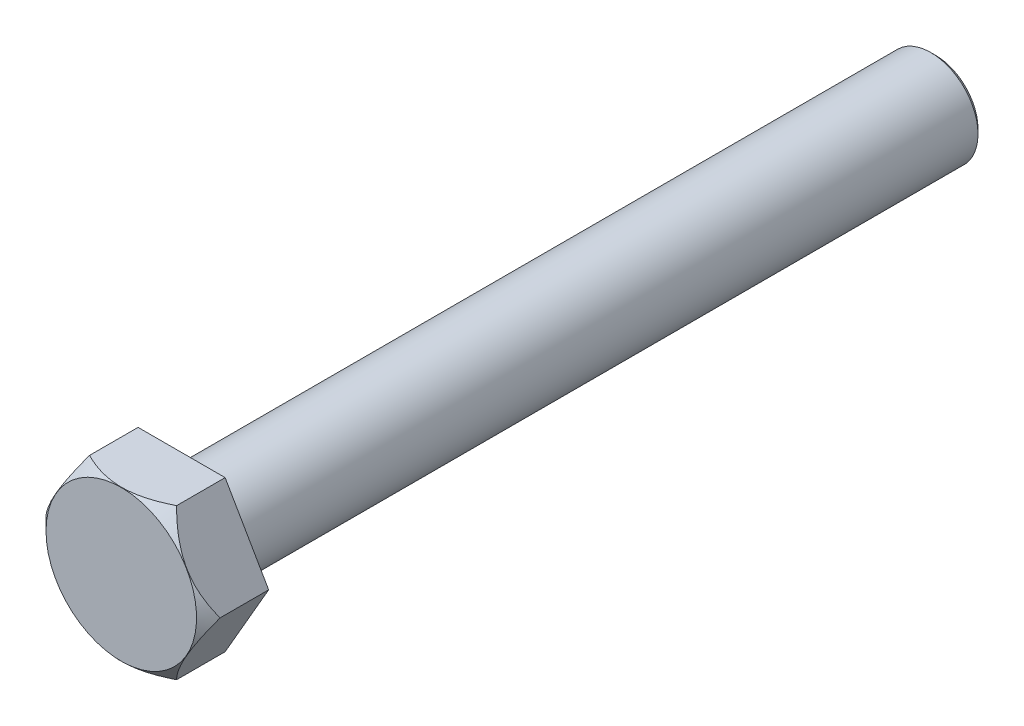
ISO-10303-21;
HEADER;
FILE_DESCRIPTION(('STEP AP214'),'2;1');
FILE_NAME('part.step','',(''),(''),'','','');
FILE_SCHEMA(('AUTOMOTIVE_DESIGN { 1 0 10303 214 1 1 1 1 }'));
ENDSEC;
DATA;
#1=APPLICATION_CONTEXT('core data for automotive mechanical design processes');
#2=APPLICATION_PROTOCOL_DEFINITION('international standard','automotive_design',2000,#1);
#3=PRODUCT_CONTEXT('',#1,'mechanical');
#4=PRODUCT('Part','Part','',(#3));
#5=PRODUCT_RELATED_PRODUCT_CATEGORY('part','',(#4));
#6=PRODUCT_DEFINITION_FORMATION('','',#4);
#7=PRODUCT_DEFINITION_CONTEXT('part definition',#1,'design');
#8=PRODUCT_DEFINITION('design','',#6,#7);
#9=PRODUCT_DEFINITION_SHAPE('','',#8);
#10=(LENGTH_UNIT() NAMED_UNIT(*) SI_UNIT(.MILLI.,.METRE.));
#11=(NAMED_UNIT(*) PLANE_ANGLE_UNIT() SI_UNIT($,.RADIAN.));
#12=(NAMED_UNIT(*) SI_UNIT($,.STERADIAN.) SOLID_ANGLE_UNIT());
#13=UNCERTAINTY_MEASURE_WITH_UNIT(LENGTH_MEASURE(1.E-05),#10,'distance_accuracy_value','');
#14=(GEOMETRIC_REPRESENTATION_CONTEXT(3) GLOBAL_UNCERTAINTY_ASSIGNED_CONTEXT((#13)) GLOBAL_UNIT_ASSIGNED_CONTEXT((#10,
#11,#12)) REPRESENTATION_CONTEXT('',''));
#15=CARTESIAN_POINT('',(0.,0.,0.));
#16=DIRECTION('',(0.,0.,1.));
#17=DIRECTION('',(1.,0.,0.));
#18=AXIS2_PLACEMENT_3D('',#15,#16,#17);
#19=CARTESIAN_POINT('',(0.,-5.,0.));
#20=DIRECTION('',(0.,0.,1.));
#21=DIRECTION('',(1.,0.,0.));
#22=AXIS2_PLACEMENT_3D('',#19,#20,#21);
#23=PLANE('',#22);
#24=CARTESIAN_POINT('',(0.,0.,0.));
#25=DIRECTION('',(0.,0.,1.));
#26=DIRECTION('',(1.,0.,0.));
#27=AXIS2_PLACEMENT_3D('',#24,#25,#26);
#28=CIRCLE('',#27,5.);
#29=CARTESIAN_POINT('',(5.,0.,0.));
#30=VERTEX_POINT('',#29);
#31=EDGE_CURVE('E11',#30,#30,#28,.T.);
#32=ORIENTED_EDGE('',*,*,#31,.T.);
#33=EDGE_LOOP('',(#32));
#34=FACE_BOUND('',#33,.T.);
#35=ADVANCED_FACE('F38',(#34),#23,.T.);
#36=CARTESIAN_POINT('',(0.,0.,0.));
#37=DIRECTION('',(0.,0.,1.));
#38=DIRECTION('',(1.,0.,0.));
#39=AXIS2_PLACEMENT_3D('',#36,#37,#38);
#40=CYLINDRICAL_SURFACE('',#39,5.);
#41=CARTESIAN_POINT('',(0.,0.,-79.5));
#42=DIRECTION('',(0.,0.,1.));
#43=DIRECTION('',(1.,0.,0.));
#44=AXIS2_PLACEMENT_3D('',#41,#42,#43);
#45=CIRCLE('',#44,5.);
#46=CARTESIAN_POINT('',(5.,0.,-79.5));
#47=VERTEX_POINT('',#46);
#48=EDGE_CURVE('E44',#47,#47,#45,.T.);
#49=ORIENTED_EDGE('',*,*,#48,.T.);
#50=EDGE_LOOP('',(#49));
#51=FACE_BOUND('',#50,.T.);
#52=ORIENTED_EDGE('',*,*,#31,.F.);
#53=EDGE_LOOP('',(#52));
#54=FACE_BOUND('',#53,.T.);
#55=ADVANCED_FACE('F64',(#51,#54),#40,.T.);
#56=CARTESIAN_POINT('',(0.,0.,-79.5));
#57=DIRECTION('',(0.,0.,1.));
#58=DIRECTION('',(1.,0.,0.));
#59=AXIS2_PLACEMENT_3D('',#56,#57,#58);
#60=CONICAL_SURFACE('',#59,5.,0.785398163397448);
#61=CARTESIAN_POINT('',(0.,0.,-80.));
#62=DIRECTION('',(0.,0.,1.));
#63=DIRECTION('',(1.,0.,0.));
#64=AXIS2_PLACEMENT_3D('',#61,#62,#63);
#65=CIRCLE('',#64,4.5);
#66=CARTESIAN_POINT('',(4.5,0.,-80.));
#67=VERTEX_POINT('',#66);
#68=EDGE_CURVE('E48',#67,#67,#65,.T.);
#69=ORIENTED_EDGE('',*,*,#68,.T.);
#70=EDGE_LOOP('',(#69));
#71=FACE_BOUND('',#70,.T.);
#72=ORIENTED_EDGE('',*,*,#48,.F.);
#73=EDGE_LOOP('',(#72));
#74=FACE_BOUND('',#73,.T.);
#75=ADVANCED_FACE('F55',(#71,#74),#60,.T.);
#76=CARTESIAN_POINT('',(0.,-4.5,-80.));
#77=DIRECTION('',(0.,0.,-1.));
#78=DIRECTION('',(-1.,0.,0.));
#79=AXIS2_PLACEMENT_3D('',#76,#77,#78);
#80=PLANE('',#79);
#81=ORIENTED_EDGE('',*,*,#68,.F.);
#82=EDGE_LOOP('',(#81));
#83=FACE_BOUND('',#82,.T.);
#84=ADVANCED_FACE('F58',(#83),#80,.T.);
#85=CLOSED_SHELL('',(#35,#55,#75,#84));
#86=MANIFOLD_SOLID_BREP('B2',#85);
#87=CARTESIAN_POINT('',(4.61880215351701,-8.,6.4));
#88=DIRECTION('',(-0.866025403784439,0.5,0.));
#89=DIRECTION('',(-0.5,-0.866025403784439,0.));
#90=AXIS2_PLACEMENT_3D('',#87,#88,#89);
#91=PLANE('',#90);
#92=DIRECTION('',(0.,0.,-1.));
#93=VECTOR('',#92,1.);
#94=CARTESIAN_POINT('',(9.23760430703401,0.,6.4));
#95=LINE('',#94,#93);
#96=CARTESIAN_POINT('',(9.23760430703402,0.,5.15));
#97=VERTEX_POINT('',#96);
#98=CARTESIAN_POINT('',(9.23760430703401,0.,0.));
#99=VERTEX_POINT('',#98);
#100=EDGE_CURVE('E36',#97,#99,#95,.T.);
#101=ORIENTED_EDGE('',*,*,#100,.F.);
#102=CARTESIAN_POINT('',(9.23771977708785,0.0002,5.14988452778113));
#103=CARTESIAN_POINT('',(9.15830362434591,-0.137352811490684,5.22929173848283));
#104=CARTESIAN_POINT('',(9.07827704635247,-0.275962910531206,5.30626202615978));
#105=CARTESIAN_POINT('',(8.91688328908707,-0.555505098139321,5.45458746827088));
#106=CARTESIAN_POINT('',(8.83551540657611,-0.696438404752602,5.52593955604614));
#107=CARTESIAN_POINT('',(8.58846429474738,-1.12434348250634,5.7310650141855));
#108=CARTESIAN_POINT('',(8.42068969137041,-1.41493761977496,5.85503254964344));
#109=CARTESIAN_POINT('',(8.08235881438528,-2.00094388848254,6.0673182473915));
#110=CARTESIAN_POINT('',(7.91188900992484,-2.29620625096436,6.15617121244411));
#111=CARTESIAN_POINT('',(7.65338180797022,-2.74395385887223,6.25895214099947));
#112=CARTESIAN_POINT('',(7.5668321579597,-2.89386225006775,6.2881156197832));
#113=CARTESIAN_POINT('',(7.39300005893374,-3.19494827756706,6.33561647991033));
#114=CARTESIAN_POINT('',(7.30571772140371,-3.34612572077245,6.35395547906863));
#115=CARTESIAN_POINT('',(7.09302093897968,-3.71452735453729,6.38470362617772));
#116=CARTESIAN_POINT('',(6.96737731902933,-3.93214848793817,6.3911549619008));
#117=CARTESIAN_POINT('',(6.71631655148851,-4.36699849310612,6.38032538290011));
#118=CARTESIAN_POINT('',(6.59089949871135,-4.58422720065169,6.36303614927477));
#119=CARTESIAN_POINT('',(6.3412478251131,-5.01663658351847,6.30574456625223));
#120=CARTESIAN_POINT('',(6.21701468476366,-5.23181469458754,6.26571681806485));
#121=CARTESIAN_POINT('',(5.97068367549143,-5.65847251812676,6.16512435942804));
#122=CARTESIAN_POINT('',(5.84858564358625,-5.86995251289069,6.1045612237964));
#123=CARTESIAN_POINT('',(5.63184322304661,-6.24536139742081,5.97996636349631));
#124=CARTESIAN_POINT('',(5.53671883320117,-6.41012167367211,5.91921187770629));
#125=CARTESIAN_POINT('',(5.34817758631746,-6.73668469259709,5.78791284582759));
#126=CARTESIAN_POINT('',(5.25476078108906,-6.89848734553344,5.7173680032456));
#127=CARTESIAN_POINT('',(5.06992894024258,-7.21862548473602,5.56806952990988));
#128=CARTESIAN_POINT('',(4.97850864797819,-7.37697007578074,5.48934171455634));
#129=CARTESIAN_POINT('',(4.79736084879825,-7.69072726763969,5.32471082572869));
#130=CARTESIAN_POINT('',(4.70763234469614,-7.84614159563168,5.23881215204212));
#131=CARTESIAN_POINT('',(4.61868668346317,-8.0002,5.14988452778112));
#132=B_SPLINE_CURVE_WITH_KNOTS('',3,(#102,#103,#104,#105,#106,#107,#108,#109,#110,#111,#112,
#113,#114,#115,#116,#117,#118,#119,#120,#121,#122,#123,#124,#125,#126,#127,#128,#129,#130,#131),
.UNSPECIFIED.,.F.,.F.,(4,2,2,2,2,2,2,2,2,2,2,2,2,2,4),(0.,0.532696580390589,1.06568194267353,
2.13740664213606,3.19211397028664,3.71843331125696,4.24467396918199,4.99761238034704,
5.75081469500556,6.50485999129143,7.25884747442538,7.85770857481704,8.45658781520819,
9.05363199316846,9.65031250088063),.UNSPECIFIED.);
#133=CARTESIAN_POINT('',(4.61880215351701,-8.,5.15));
#134=VERTEX_POINT('',#133);
#135=EDGE_CURVE('E199',#97,#134,#132,.T.);
#136=ORIENTED_EDGE('',*,*,#135,.T.);
#137=DIRECTION('',(0.,0.,-1.));
#138=VECTOR('',#137,1.);
#139=CARTESIAN_POINT('',(4.61880215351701,-8.,6.4));
#140=LINE('',#139,#138);
#141=CARTESIAN_POINT('',(4.61880215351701,-8.,0.));
#142=VERTEX_POINT('',#141);
#143=EDGE_CURVE('E116',#134,#142,#140,.T.);
#144=ORIENTED_EDGE('',*,*,#143,.T.);
#145=DIRECTION('',(0.5,0.866025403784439,0.));
#146=VECTOR('',#145,1.);
#147=CARTESIAN_POINT('',(4.61880215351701,-8.,0.));
#148=LINE('',#147,#146);
#149=EDGE_CURVE('E186',#142,#99,#148,.T.);
#150=ORIENTED_EDGE('',*,*,#149,.T.);
#151=EDGE_LOOP('',(#101,#136,#144,#150));
#152=FACE_BOUND('',#151,.T.);
#153=ADVANCED_FACE('F93',(#152),#91,.F.);
#154=CARTESIAN_POINT('',(9.23760430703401,0.,6.4));
#155=DIRECTION('',(-0.866025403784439,-0.5,0.));
#156=DIRECTION('',(0.5,-0.866025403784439,0.));
#157=AXIS2_PLACEMENT_3D('',#154,#155,#156);
#158=PLANE('',#157);
#159=DIRECTION('',(0.,0.,-1.));
#160=VECTOR('',#159,1.);
#161=CARTESIAN_POINT('',(4.61880215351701,8.,6.4));
#162=LINE('',#161,#160);
#163=CARTESIAN_POINT('',(4.61880215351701,8.,5.15));
#164=VERTEX_POINT('',#163);
#165=CARTESIAN_POINT('',(4.61880215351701,8.,0.));
#166=VERTEX_POINT('',#165);
#167=EDGE_CURVE('E101',#164,#166,#162,.T.);
#168=ORIENTED_EDGE('',*,*,#167,.F.);
#169=CARTESIAN_POINT('',(4.61868668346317,8.0002,5.14988452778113));
#170=CARTESIAN_POINT('',(4.69810283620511,7.86264718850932,5.22929173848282));
#171=CARTESIAN_POINT('',(4.77812941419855,7.7240370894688,5.30626202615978));
#172=CARTESIAN_POINT('',(4.93952317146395,7.44449490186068,5.45458746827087));
#173=CARTESIAN_POINT('',(5.02089105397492,7.3035615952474,5.52593955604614));
#174=CARTESIAN_POINT('',(5.26794216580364,6.87565651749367,5.7310650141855));
#175=CARTESIAN_POINT('',(5.43571676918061,6.58506238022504,5.85503254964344));
#176=CARTESIAN_POINT('',(5.77404764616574,5.99905611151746,6.0673182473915));
#177=CARTESIAN_POINT('',(5.94451745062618,5.70379374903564,6.15617121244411));
#178=CARTESIAN_POINT('',(6.2030246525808,5.25604614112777,6.25895214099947));
#179=CARTESIAN_POINT('',(6.28957430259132,5.10613774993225,6.2881156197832));
#180=CARTESIAN_POINT('',(6.46340640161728,4.80505172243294,6.33561647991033));
#181=CARTESIAN_POINT('',(6.55068873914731,4.65387427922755,6.35395547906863));
#182=CARTESIAN_POINT('',(6.76338552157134,4.28547264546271,6.38470362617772));
#183=CARTESIAN_POINT('',(6.88902914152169,4.06785151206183,6.3911549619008));
#184=CARTESIAN_POINT('',(7.14008990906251,3.63300150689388,6.38032538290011));
#185=CARTESIAN_POINT('',(7.26550696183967,3.41577279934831,6.36303614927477));
#186=CARTESIAN_POINT('',(7.51515863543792,2.98336341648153,6.30574456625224));
#187=CARTESIAN_POINT('',(7.63939177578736,2.76818530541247,6.26571681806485));
#188=CARTESIAN_POINT('',(7.88572278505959,2.34152748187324,6.16512435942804));
#189=CARTESIAN_POINT('',(8.00782081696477,2.13004748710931,6.1045612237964));
#190=CARTESIAN_POINT('',(8.22456323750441,1.75463860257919,5.97996636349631));
#191=CARTESIAN_POINT('',(8.31968762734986,1.58987832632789,5.91921187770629));
#192=CARTESIAN_POINT('',(8.50822887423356,1.26331530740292,5.78791284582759));
#193=CARTESIAN_POINT('',(8.60164567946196,1.10151265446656,5.7173680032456));
#194=CARTESIAN_POINT('',(8.78647752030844,0.78137451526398,5.56806952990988));
#195=CARTESIAN_POINT('',(8.87789781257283,0.623029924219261,5.48934171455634));
#196=CARTESIAN_POINT('',(9.05904561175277,0.309272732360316,5.3247108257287));
#197=CARTESIAN_POINT('',(9.14877411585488,0.153858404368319,5.23881215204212));
#198=CARTESIAN_POINT('',(9.23771977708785,-0.000200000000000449,5.14988452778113));
#199=B_SPLINE_CURVE_WITH_KNOTS('',3,(#169,#170,#171,#172,#173,#174,#175,#176,#177,#178,#179,
#180,#181,#182,#183,#184,#185,#186,#187,#188,#189,#190,#191,#192,#193,#194,#195,#196,#197,#198),
.UNSPECIFIED.,.F.,.F.,(4,2,2,2,2,2,2,2,2,2,2,2,2,2,4),(0.,0.53269658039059,1.06568194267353,
2.13740664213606,3.19211397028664,3.71843331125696,4.24467396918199,4.99761238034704,
5.75081469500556,6.50485999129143,7.25884747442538,7.85770857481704,8.45658781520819,
9.05363199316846,9.65031250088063),.UNSPECIFIED.);
#200=EDGE_CURVE('E200',#164,#97,#199,.T.);
#201=ORIENTED_EDGE('',*,*,#200,.T.);
#202=ORIENTED_EDGE('',*,*,#100,.T.);
#203=DIRECTION('',(-0.5,0.866025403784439,0.));
#204=VECTOR('',#203,1.);
#205=CARTESIAN_POINT('',(9.23760430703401,0.,0.));
#206=LINE('',#205,#204);
#207=EDGE_CURVE('E181',#99,#166,#206,.T.);
#208=ORIENTED_EDGE('',*,*,#207,.T.);
#209=EDGE_LOOP('',(#168,#201,#202,#208));
#210=FACE_BOUND('',#209,.T.);
#211=ADVANCED_FACE('F182',(#210),#158,.F.);
#212=CARTESIAN_POINT('',(4.61880215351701,8.,6.4));
#213=DIRECTION('',(0.,-1.,0.));
#214=DIRECTION('',(1.,0.,0.));
#215=AXIS2_PLACEMENT_3D('',#212,#213,#214);
#216=PLANE('',#215);
#217=DIRECTION('',(0.,0.,-1.));
#218=VECTOR('',#217,1.);
#219=CARTESIAN_POINT('',(-4.61880215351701,8.00000000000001,6.4));
#220=LINE('',#219,#218);
#221=CARTESIAN_POINT('',(-4.61880215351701,8.,5.15));
#222=VERTEX_POINT('',#221);
#223=CARTESIAN_POINT('',(-4.61880215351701,8.00000000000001,0.));
#224=VERTEX_POINT('',#223);
#225=EDGE_CURVE('E166',#222,#224,#220,.T.);
#226=ORIENTED_EDGE('',*,*,#225,.F.);
#227=CARTESIAN_POINT('',(-9.63405633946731,8.00000000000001,1.86502304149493));
#228=CARTESIAN_POINT('',(-9.40128275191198,8.00000000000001,2.0440636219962));
#229=CARTESIAN_POINT('',(-9.16725436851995,8.00000000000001,2.22149846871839));
#230=CARTESIAN_POINT('',(-8.69617533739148,8.00000000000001,2.57242325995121));
#231=CARTESIAN_POINT('',(-8.45912398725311,8.00000000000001,2.74591226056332));
#232=CARTESIAN_POINT('',(-7.97975398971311,8.00000000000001,3.08944656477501));
#233=CARTESIAN_POINT('',(-7.73740881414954,8.00000000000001,3.2594549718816));
#234=CARTESIAN_POINT('',(-7.24868415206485,8.00000000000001,3.59355068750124));
#235=CARTESIAN_POINT('',(-7.00230494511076,8.00000000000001,3.75763840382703));
#236=CARTESIAN_POINT('',(-6.48908013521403,8.00000000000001,4.08870680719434));
#237=CARTESIAN_POINT('',(-6.2219265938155,8.00000000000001,4.25521252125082));
#238=CARTESIAN_POINT('',(-5.68134615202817,8.00000000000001,4.57788231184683));
#239=CARTESIAN_POINT('',(-5.40791820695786,8.00000000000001,4.73404464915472));
#240=CARTESIAN_POINT('',(-4.85471531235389,8.00000000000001,5.0327014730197));
#241=CARTESIAN_POINT('',(-4.57496219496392,8.00000000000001,5.17523608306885));
#242=CARTESIAN_POINT('',(-4.00755071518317,8.00000000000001,5.44344401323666));
#243=CARTESIAN_POINT('',(-3.71989615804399,8.00000000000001,5.56912528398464));
#244=CARTESIAN_POINT('',(-3.16480511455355,8.00000000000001,5.78774810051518));
#245=CARTESIAN_POINT('',(-2.89816645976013,8.00000000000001,5.88269477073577));
#246=CARTESIAN_POINT('',(-2.35810027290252,8.00000000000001,6.05124489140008));
#247=CARTESIAN_POINT('',(-2.0846723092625,8.,6.12484698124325));
#248=CARTESIAN_POINT('',(-1.5374201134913,8.,6.24549882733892));
#249=CARTESIAN_POINT('',(-1.2637039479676,8.,6.29303051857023));
#250=CARTESIAN_POINT('',(-0.712876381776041,8.,6.36055070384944));
#251=CARTESIAN_POINT('',(-0.435765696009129,8.,6.38054490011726));
#252=CARTESIAN_POINT('',(0.106931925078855,8.,6.39128945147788));
#253=CARTESIAN_POINT('',(0.372494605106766,8.,6.38327664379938));
#254=CARTESIAN_POINT('',(0.901545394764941,8.,6.34128781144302));
#255=CARTESIAN_POINT('',(1.16503331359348,8.,6.30730942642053));
#256=CARTESIAN_POINT('',(1.69249295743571,8.,6.21473235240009));
#257=CARTESIAN_POINT('',(1.9563871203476,8.,6.15569917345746));
#258=CARTESIAN_POINT('',(2.47836483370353,8.,6.01628611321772));
#259=CARTESIAN_POINT('',(2.73644871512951,8.,5.93590745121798));
#260=CARTESIAN_POINT('',(3.26112199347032,8.,5.75215229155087));
#261=CARTESIAN_POINT('',(3.52733413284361,8.,5.64771079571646));
#262=CARTESIAN_POINT('',(4.0529103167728,8.,5.42269321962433));
#263=CARTESIAN_POINT('',(4.31227120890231,8.,5.30210986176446));
#264=CARTESIAN_POINT('',(4.82537016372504,8.,5.0476682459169));
#265=CARTESIAN_POINT('',(5.07908778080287,8.,4.91376909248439));
#266=CARTESIAN_POINT('',(5.5807089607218,8.,4.63564261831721));
#267=CARTESIAN_POINT('',(5.82861341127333,8.,4.49141688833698));
#268=CARTESIAN_POINT('',(6.30725136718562,8.,4.20198106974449));
#269=CARTESIAN_POINT('',(6.53822825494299,8.,4.05717133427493));
#270=CARTESIAN_POINT('',(6.99621369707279,8.,3.76138871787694));
#271=CARTESIAN_POINT('',(7.22322195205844,8.,3.61041537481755));
#272=CARTESIAN_POINT('',(7.67196405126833,8.,3.30463392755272));
#273=CARTESIAN_POINT('',(7.89372561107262,8.,3.14986635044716));
#274=CARTESIAN_POINT('',(8.33420656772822,8.,2.8361829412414));
#275=CARTESIAN_POINT('',(8.55292678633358,8.,2.67726826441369));
#276=CARTESIAN_POINT('',(8.77037123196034,8.,2.51665609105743));
#277=B_SPLINE_CURVE_WITH_KNOTS('',3,(#227,#228,#229,#230,#231,#232,#233,#234,#235,#236,#237,
#238,#239,#240,#241,#242,#243,#244,#245,#246,#247,#248,#249,#250,#251,#252,#253,#254,#255,#256,
#257,#258,#259,#260,#261,#262,#263,#264,#265,#266,#267,#268,#269,#270,#271,#272,#273,#274,#275,
#276),.UNSPECIFIED.,.F.,.F.,(4,2,2,2,2,2,2,2,2,2,2,2,2,2,2,2,2,2,2,2,2,2,2,2,4),(0.,
0.881010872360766,1.76223032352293,2.65024868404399,3.53820576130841,4.48240113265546,
5.42675486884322,6.36823655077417,7.30927251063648,8.15765736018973,9.00609627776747,
9.83827152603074,10.6702744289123,11.4660076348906,12.26181318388,13.0720226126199,
13.8821857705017,14.7394283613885,15.5970587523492,16.4574095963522,17.3176281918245,
18.1353653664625,18.9531639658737,19.7643957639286,20.5754039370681),.UNSPECIFIED.);
#278=EDGE_CURVE('E148',#222,#164,#277,.T.);
#279=ORIENTED_EDGE('',*,*,#278,.T.);
#280=ORIENTED_EDGE('',*,*,#167,.T.);
#281=DIRECTION('',(-1.,0.,0.));
#282=VECTOR('',#281,1.);
#283=CARTESIAN_POINT('',(4.61880215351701,8.,0.));
#284=LINE('',#283,#282);
#285=EDGE_CURVE('E177',#166,#224,#284,.T.);
#286=ORIENTED_EDGE('',*,*,#285,.T.);
#287=EDGE_LOOP('',(#226,#279,#280,#286));
#288=FACE_BOUND('',#287,.T.);
#289=ADVANCED_FACE('F175',(#288),#216,.F.);
#290=CARTESIAN_POINT('',(-4.61880215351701,8.00000000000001,6.4));
#291=DIRECTION('',(0.866025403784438,-0.5,0.));
#292=DIRECTION('',(0.5,0.866025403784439,0.));
#293=AXIS2_PLACEMENT_3D('',#290,#291,#292);
#294=PLANE('',#293);
#295=DIRECTION('',(0.,0.,-1.));
#296=VECTOR('',#295,1.);
#297=CARTESIAN_POINT('',(-9.23760430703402,0.,6.4));
#298=LINE('',#297,#296);
#299=CARTESIAN_POINT('',(-9.23760430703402,0.,5.15));
#300=VERTEX_POINT('',#299);
#301=CARTESIAN_POINT('',(-9.23760430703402,0.,0.));
#302=VERTEX_POINT('',#301);
#303=EDGE_CURVE('E157',#300,#302,#298,.T.);
#304=ORIENTED_EDGE('',*,*,#303,.F.);
#305=CARTESIAN_POINT('',(-9.23771977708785,-0.000199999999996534,5.14988452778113));
#306=CARTESIAN_POINT('',(-9.15830362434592,0.137352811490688,5.22929173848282));
#307=CARTESIAN_POINT('',(-9.07827704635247,0.27596291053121,5.30626202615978));
#308=CARTESIAN_POINT('',(-8.91688328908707,0.555505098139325,5.45458746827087));
#309=CARTESIAN_POINT('',(-8.83551540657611,0.696438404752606,5.52593955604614));
#310=CARTESIAN_POINT('',(-8.58846429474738,1.12434348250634,5.7310650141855));
#311=CARTESIAN_POINT('',(-8.42068969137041,1.41493761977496,5.85503254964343));
#312=CARTESIAN_POINT('',(-8.08235881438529,2.00094388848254,6.0673182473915));
#313=CARTESIAN_POINT('',(-7.91188900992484,2.29620625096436,6.15617121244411));
#314=CARTESIAN_POINT('',(-7.65338180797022,2.74395385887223,6.25895214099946));
#315=CARTESIAN_POINT('',(-7.56683215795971,2.89386225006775,6.28811561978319));
#316=CARTESIAN_POINT('',(-7.39300005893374,3.19494827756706,6.33561647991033));
#317=CARTESIAN_POINT('',(-7.30571772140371,3.34612572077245,6.35395547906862));
#318=CARTESIAN_POINT('',(-7.09302093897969,3.71452735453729,6.38470362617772));
#319=CARTESIAN_POINT('',(-6.96737731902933,3.93214848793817,6.3911549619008));
#320=CARTESIAN_POINT('',(-6.71631655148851,4.36699849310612,6.38032538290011));
#321=CARTESIAN_POINT('',(-6.59089949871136,4.58422720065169,6.36303614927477));
#322=CARTESIAN_POINT('',(-6.3412478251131,5.01663658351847,6.30574456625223));
#323=CARTESIAN_POINT('',(-6.21701468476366,5.23181469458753,6.26571681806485));
#324=CARTESIAN_POINT('',(-5.97068367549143,5.65847251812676,6.16512435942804));
#325=CARTESIAN_POINT('',(-5.84858564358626,5.86995251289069,6.1045612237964));
#326=CARTESIAN_POINT('',(-5.63184322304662,6.24536139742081,5.97996636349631));
#327=CARTESIAN_POINT('',(-5.53671883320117,6.41012167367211,5.91921187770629));
#328=CARTESIAN_POINT('',(-5.34817758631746,6.73668469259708,5.78791284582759));
#329=CARTESIAN_POINT('',(-5.25476078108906,6.89848734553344,5.7173680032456));
#330=CARTESIAN_POINT('',(-5.06992894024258,7.21862548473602,5.56806952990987));
#331=CARTESIAN_POINT('',(-4.97850864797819,7.37697007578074,5.48934171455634));
#332=CARTESIAN_POINT('',(-4.79736084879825,7.69072726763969,5.32471082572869));
#333=CARTESIAN_POINT('',(-4.70763234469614,7.84614159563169,5.23881215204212));
#334=CARTESIAN_POINT('',(-4.61868668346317,8.00020000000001,5.14988452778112));
#335=B_SPLINE_CURVE_WITH_KNOTS('',3,(#305,#306,#307,#308,#309,#310,#311,#312,#313,#314,#315,
#316,#317,#318,#319,#320,#321,#322,#323,#324,#325,#326,#327,#328,#329,#330,#331,#332,#333,#334),
.UNSPECIFIED.,.F.,.F.,(4,2,2,2,2,2,2,2,2,2,2,2,2,2,4),(0.,0.532696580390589,1.06568194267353,
2.13740664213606,3.19211397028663,3.71843331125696,4.24467396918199,4.99761238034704,
5.75081469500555,6.50485999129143,7.25884747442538,7.85770857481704,8.45658781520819,
9.05363199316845,9.65031250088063),.UNSPECIFIED.);
#336=EDGE_CURVE('E145',#300,#222,#335,.T.);
#337=ORIENTED_EDGE('',*,*,#336,.T.);
#338=ORIENTED_EDGE('',*,*,#225,.T.);
#339=DIRECTION('',(-0.5,-0.866025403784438,0.));
#340=VECTOR('',#339,1.);
#341=CARTESIAN_POINT('',(-4.61880215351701,8.00000000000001,0.));
#342=LINE('',#341,#340);
#343=EDGE_CURVE('E164',#224,#302,#342,.T.);
#344=ORIENTED_EDGE('',*,*,#343,.T.);
#345=EDGE_LOOP('',(#304,#337,#338,#344));
#346=FACE_BOUND('',#345,.T.);
#347=ADVANCED_FACE('F162',(#346),#294,.F.);
#348=CARTESIAN_POINT('',(-9.23760430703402,0.,6.4));
#349=DIRECTION('',(0.866025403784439,0.5,0.));
#350=DIRECTION('',(-0.5,0.866025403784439,0.));
#351=AXIS2_PLACEMENT_3D('',#348,#349,#350);
#352=PLANE('',#351);
#353=DIRECTION('',(0.,0.,-1.));
#354=VECTOR('',#353,1.);
#355=CARTESIAN_POINT('',(-4.61880215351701,-8.,6.4));
#356=LINE('',#355,#354);
#357=CARTESIAN_POINT('',(-4.61880215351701,-8.,5.15));
#358=VERTEX_POINT('',#357);
#359=CARTESIAN_POINT('',(-4.61880215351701,-8.,0.));
#360=VERTEX_POINT('',#359);
#361=EDGE_CURVE('E159',#358,#360,#356,.T.);
#362=ORIENTED_EDGE('',*,*,#361,.F.);
#363=CARTESIAN_POINT('',(-4.61868668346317,-8.0002,5.14988452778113));
#364=CARTESIAN_POINT('',(-4.69810283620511,-7.86264718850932,5.22929173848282));
#365=CARTESIAN_POINT('',(-4.77812941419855,-7.7240370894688,5.30626202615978));
#366=CARTESIAN_POINT('',(-4.93952317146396,-7.44449490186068,5.45458746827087));
#367=CARTESIAN_POINT('',(-5.02089105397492,-7.3035615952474,5.52593955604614));
#368=CARTESIAN_POINT('',(-5.26794216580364,-6.87565651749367,5.7310650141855));
#369=CARTESIAN_POINT('',(-5.43571676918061,-6.58506238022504,5.85503254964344));
#370=CARTESIAN_POINT('',(-5.77404764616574,-5.99905611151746,6.0673182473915));
#371=CARTESIAN_POINT('',(-5.94451745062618,-5.70379374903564,6.15617121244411));
#372=CARTESIAN_POINT('',(-6.2030246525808,-5.25604614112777,6.25895214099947));
#373=CARTESIAN_POINT('',(-6.28957430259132,-5.10613774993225,6.2881156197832));
#374=CARTESIAN_POINT('',(-6.46340640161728,-4.80505172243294,6.33561647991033));
#375=CARTESIAN_POINT('',(-6.55068873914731,-4.65387427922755,6.35395547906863));
#376=CARTESIAN_POINT('',(-6.76338552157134,-4.28547264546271,6.38470362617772));
#377=CARTESIAN_POINT('',(-6.88902914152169,-4.06785151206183,6.3911549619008));
#378=CARTESIAN_POINT('',(-7.14008990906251,-3.63300150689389,6.38032538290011));
#379=CARTESIAN_POINT('',(-7.26550696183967,-3.41577279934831,6.36303614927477));
#380=CARTESIAN_POINT('',(-7.51515863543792,-2.98336341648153,6.30574456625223));
#381=CARTESIAN_POINT('',(-7.63939177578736,-2.76818530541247,6.26571681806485));
#382=CARTESIAN_POINT('',(-7.88572278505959,-2.34152748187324,6.16512435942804));
#383=CARTESIAN_POINT('',(-8.00782081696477,-2.13004748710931,6.1045612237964));
#384=CARTESIAN_POINT('',(-8.22456323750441,-1.75463860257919,5.97996636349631));
#385=CARTESIAN_POINT('',(-8.31968762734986,-1.58987832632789,5.91921187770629));
#386=CARTESIAN_POINT('',(-8.50822887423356,-1.26331530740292,5.78791284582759));
#387=CARTESIAN_POINT('',(-8.60164567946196,-1.10151265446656,5.7173680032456));
#388=CARTESIAN_POINT('',(-8.78647752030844,-0.78137451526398,5.56806952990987));
#389=CARTESIAN_POINT('',(-8.87789781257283,-0.62302992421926,5.48934171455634));
#390=CARTESIAN_POINT('',(-9.05904561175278,-0.309272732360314,5.32471082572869));
#391=CARTESIAN_POINT('',(-9.14877411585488,-0.153858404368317,5.23881215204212));
#392=CARTESIAN_POINT('',(-9.23771977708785,0.000200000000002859,5.14988452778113));
#393=B_SPLINE_CURVE_WITH_KNOTS('',3,(#363,#364,#365,#366,#367,#368,#369,#370,#371,#372,#373,
#374,#375,#376,#377,#378,#379,#380,#381,#382,#383,#384,#385,#386,#387,#388,#389,#390,#391,#392),
.UNSPECIFIED.,.F.,.F.,(4,2,2,2,2,2,2,2,2,2,2,2,2,2,4),(0.,0.532696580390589,1.06568194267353,
2.13740664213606,3.19211397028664,3.71843331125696,4.24467396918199,4.99761238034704,
5.75081469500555,6.50485999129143,7.25884747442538,7.85770857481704,8.45658781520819,
9.05363199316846,9.65031250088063),.UNSPECIFIED.);
#394=EDGE_CURVE('E108',#358,#300,#393,.T.);
#395=ORIENTED_EDGE('',*,*,#394,.T.);
#396=ORIENTED_EDGE('',*,*,#303,.T.);
#397=DIRECTION('',(0.5,-0.866025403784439,0.));
#398=VECTOR('',#397,1.);
#399=CARTESIAN_POINT('',(-9.23760430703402,0.,0.));
#400=LINE('',#399,#398);
#401=EDGE_CURVE('E190',#302,#360,#400,.T.);
#402=ORIENTED_EDGE('',*,*,#401,.T.);
#403=EDGE_LOOP('',(#362,#395,#396,#402));
#404=FACE_BOUND('',#403,.T.);
#405=ADVANCED_FACE('F155',(#404),#352,.F.);
#406=CARTESIAN_POINT('',(-4.61880215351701,-8.,6.4));
#407=DIRECTION('',(0.,1.,0.));
#408=DIRECTION('',(-1.,0.,0.));
#409=AXIS2_PLACEMENT_3D('',#406,#407,#408);
#410=PLANE('',#409);
#411=ORIENTED_EDGE('',*,*,#143,.F.);
#412=CARTESIAN_POINT('',(-9.63405633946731,-8.,1.86502304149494));
#413=CARTESIAN_POINT('',(-9.40128275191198,-8.,2.0440636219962));
#414=CARTESIAN_POINT('',(-9.16725436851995,-8.,2.22149846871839));
#415=CARTESIAN_POINT('',(-8.69617533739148,-8.,2.57242325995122));
#416=CARTESIAN_POINT('',(-8.45912398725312,-8.,2.74591226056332));
#417=CARTESIAN_POINT('',(-7.97975398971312,-8.,3.08944656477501));
#418=CARTESIAN_POINT('',(-7.73740881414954,-8.,3.25945497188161));
#419=CARTESIAN_POINT('',(-7.24868415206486,-8.,3.59355068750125));
#420=CARTESIAN_POINT('',(-7.00230494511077,-8.,3.75763840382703));
#421=CARTESIAN_POINT('',(-6.48908013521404,-8.,4.08870680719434));
#422=CARTESIAN_POINT('',(-6.22192659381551,-8.,4.25521252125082));
#423=CARTESIAN_POINT('',(-5.68134615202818,-8.,4.57788231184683));
#424=CARTESIAN_POINT('',(-5.40791820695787,-8.,4.73404464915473));
#425=CARTESIAN_POINT('',(-4.85471531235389,-8.,5.0327014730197));
#426=CARTESIAN_POINT('',(-4.57496219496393,-8.,5.17523608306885));
#427=CARTESIAN_POINT('',(-4.00755071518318,-8.,5.44344401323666));
#428=CARTESIAN_POINT('',(-3.719896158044,-8.,5.56912528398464));
#429=CARTESIAN_POINT('',(-3.16480511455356,-8.,5.78774810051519));
#430=CARTESIAN_POINT('',(-2.89816645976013,-8.,5.88269477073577));
#431=CARTESIAN_POINT('',(-2.35810027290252,-8.,6.05124489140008));
#432=CARTESIAN_POINT('',(-2.0846723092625,-8.,6.12484698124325));
#433=CARTESIAN_POINT('',(-1.5374201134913,-8.,6.24549882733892));
#434=CARTESIAN_POINT('',(-1.26370394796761,-8.,6.29303051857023));
#435=CARTESIAN_POINT('',(-0.712876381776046,-8.,6.36055070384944));
#436=CARTESIAN_POINT('',(-0.435765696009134,-8.,6.38054490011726));
#437=CARTESIAN_POINT('',(0.10693192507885,-8.,6.39128945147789));
#438=CARTESIAN_POINT('',(0.37249460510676,-8.,6.38327664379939));
#439=CARTESIAN_POINT('',(0.901545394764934,-8.,6.34128781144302));
#440=CARTESIAN_POINT('',(1.16503331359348,-8.,6.30730942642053));
#441=CARTESIAN_POINT('',(1.6924929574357,-8.,6.21473235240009));
#442=CARTESIAN_POINT('',(1.95638712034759,-8.,6.15569917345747));
#443=CARTESIAN_POINT('',(2.47836483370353,-8.,6.01628611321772));
#444=CARTESIAN_POINT('',(2.73644871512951,-8.,5.93590745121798));
#445=CARTESIAN_POINT('',(3.26112199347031,-8.,5.75215229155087));
#446=CARTESIAN_POINT('',(3.52733413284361,-8.,5.64771079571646));
#447=CARTESIAN_POINT('',(4.05291031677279,-8.,5.42269321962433));
#448=CARTESIAN_POINT('',(4.31227120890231,-8.,5.30210986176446));
#449=CARTESIAN_POINT('',(4.82537016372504,-8.,5.0476682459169));
#450=CARTESIAN_POINT('',(5.07908778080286,-8.,4.91376909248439));
#451=CARTESIAN_POINT('',(5.58070896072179,-8.,4.63564261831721));
#452=CARTESIAN_POINT('',(5.82861341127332,-8.,4.49141688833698));
#453=CARTESIAN_POINT('',(6.30725136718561,-8.,4.20198106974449));
#454=CARTESIAN_POINT('',(6.53822825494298,-8.,4.05717133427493));
#455=CARTESIAN_POINT('',(6.99621369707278,-8.,3.76138871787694));
#456=CARTESIAN_POINT('',(7.22322195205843,-8.00000000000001,3.61041537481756));
#457=CARTESIAN_POINT('',(7.67196405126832,-8.00000000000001,3.30463392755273));
#458=CARTESIAN_POINT('',(7.89372561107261,-8.00000000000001,3.14986635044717));
#459=CARTESIAN_POINT('',(8.33420656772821,-8.00000000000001,2.83618294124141));
#460=CARTESIAN_POINT('',(8.55292678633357,-8.00000000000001,2.67726826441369));
#461=CARTESIAN_POINT('',(8.77037123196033,-8.00000000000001,2.51665609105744));
#462=B_SPLINE_CURVE_WITH_KNOTS('',3,(#412,#413,#414,#415,#416,#417,#418,#419,#420,#421,#422,
#423,#424,#425,#426,#427,#428,#429,#430,#431,#432,#433,#434,#435,#436,#437,#438,#439,#440,#441,
#442,#443,#444,#445,#446,#447,#448,#449,#450,#451,#452,#453,#454,#455,#456,#457,#458,#459,#460,
#461),.UNSPECIFIED.,.F.,.F.,(4,2,2,2,2,2,2,2,2,2,2,2,2,2,2,2,2,2,2,2,2,2,2,2,4),(0.,
0.881010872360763,1.76223032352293,2.65024868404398,3.5382057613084,4.48240113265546,
5.42675486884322,6.36823655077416,7.30927251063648,8.15765736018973,9.00609627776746,
9.83827152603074,10.6702744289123,11.4660076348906,12.26181318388,13.0720226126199,
13.8821857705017,14.7394283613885,15.5970587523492,16.4574095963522,17.3176281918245,
18.1353653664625,18.9531639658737,19.7643957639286,20.5754039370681),.UNSPECIFIED.);
#463=EDGE_CURVE('E160',#134,#358,#462,.F.);
#464=ORIENTED_EDGE('',*,*,#463,.T.);
#465=ORIENTED_EDGE('',*,*,#361,.T.);
#466=DIRECTION('',(1.,0.,0.));
#467=VECTOR('',#466,1.);
#468=CARTESIAN_POINT('',(-4.61880215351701,-8.,0.));
#469=LINE('',#468,#467);
#470=EDGE_CURVE('E195',#360,#142,#469,.T.);
#471=ORIENTED_EDGE('',*,*,#470,.T.);
#472=EDGE_LOOP('',(#411,#464,#465,#471));
#473=FACE_BOUND('',#472,.T.);
#474=ADVANCED_FACE('F198',(#473),#410,.F.);
#475=CARTESIAN_POINT('',(9.23760430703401,0.,0.));
#476=DIRECTION('',(0.,0.,1.));
#477=DIRECTION('',(1.,0.,0.));
#478=AXIS2_PLACEMENT_3D('',#475,#476,#477);
#479=PLANE('',#478);
#480=ORIENTED_EDGE('',*,*,#149,.F.);
#481=ORIENTED_EDGE('',*,*,#470,.F.);
#482=ORIENTED_EDGE('',*,*,#401,.F.);
#483=ORIENTED_EDGE('',*,*,#343,.F.);
#484=ORIENTED_EDGE('',*,*,#285,.F.);
#485=ORIENTED_EDGE('',*,*,#207,.F.);
#486=EDGE_LOOP('',(#480,#481,#482,#483,#484,#485));
#487=FACE_BOUND('',#486,.T.);
#488=ADVANCED_FACE('F188',(#487),#479,.F.);
#489=CARTESIAN_POINT('',(0.,0.,6.4));
#490=DIRECTION('',(0.,0.,-1.));
#491=DIRECTION('',(-1.,0.,0.));
#492=AXIS2_PLACEMENT_3D('',#489,#490,#491);
#493=CONICAL_SURFACE('',#492,7.98760430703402,0.785398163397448);
#494=CARTESIAN_POINT('',(0.,0.,6.4));
#495=DIRECTION('',(0.,0.,-1.));
#496=DIRECTION('',(-1.,0.,0.));
#497=AXIS2_PLACEMENT_3D('',#494,#495,#496);
#498=CIRCLE('',#497,7.98760430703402);
#499=CARTESIAN_POINT('',(-7.98760430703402,0.,6.4));
#500=VERTEX_POINT('',#499);
#501=EDGE_CURVE('E250',#500,#500,#498,.T.);
#502=ORIENTED_EDGE('',*,*,#501,.T.);
#503=EDGE_LOOP('',(#502));
#504=FACE_BOUND('',#503,.T.);
#505=ORIENTED_EDGE('',*,*,#200,.F.);
#506=ORIENTED_EDGE('',*,*,#278,.F.);
#507=ORIENTED_EDGE('',*,*,#336,.F.);
#508=ORIENTED_EDGE('',*,*,#394,.F.);
#509=ORIENTED_EDGE('',*,*,#463,.F.);
#510=ORIENTED_EDGE('',*,*,#135,.F.);
#511=EDGE_LOOP('',(#505,#506,#507,#508,#509,#510));
#512=FACE_BOUND('',#511,.T.);
#513=ADVANCED_FACE('F146',(#504,#512),#493,.T.);
#514=CARTESIAN_POINT('',(9.23760430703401,0.,6.4));
#515=DIRECTION('',(0.,0.,1.));
#516=DIRECTION('',(1.,0.,0.));
#517=AXIS2_PLACEMENT_3D('',#514,#515,#516);
#518=PLANE('',#517);
#519=ORIENTED_EDGE('',*,*,#501,.F.);
#520=EDGE_LOOP('',(#519));
#521=FACE_BOUND('',#520,.T.);
#522=ADVANCED_FACE('F214',(#521),#518,.T.);
#523=CLOSED_SHELL('',(#153,#211,#289,#347,#405,#474,#488,#513,#522));
#524=MANIFOLD_SOLID_BREP('B6',#523);
#525=ADVANCED_BREP_SHAPE_REPRESENTATION('',(#18,#86,#524),#14);
#526=SHAPE_DEFINITION_REPRESENTATION(#9,#525);
ENDSEC;
END-ISO-10303-21;
